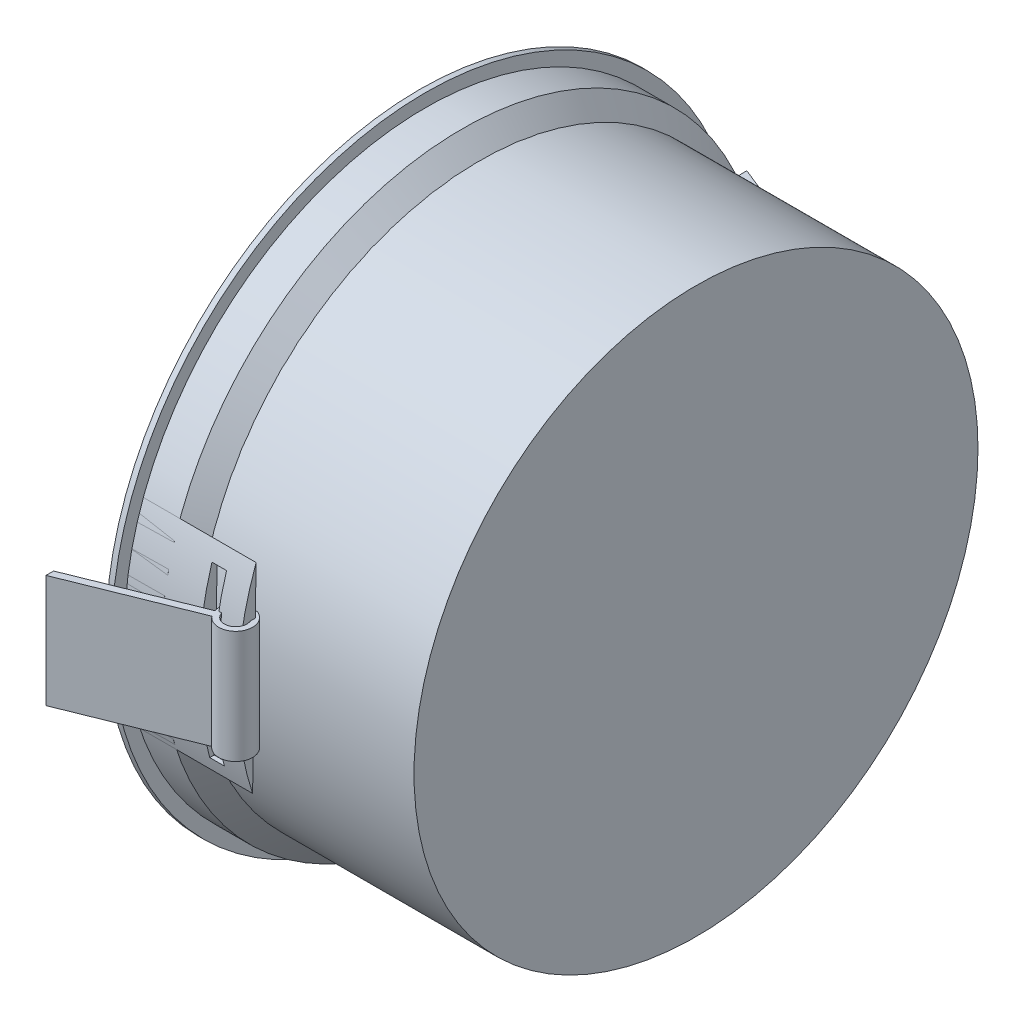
ISO-10303-21;
HEADER;
FILE_DESCRIPTION(('STEP AP214'),'2;1');
FILE_NAME('part.step','',(''),(''),'','','');
FILE_SCHEMA(('AUTOMOTIVE_DESIGN { 1 0 10303 214 1 1 1 1 }'));
ENDSEC;
DATA;
#1=APPLICATION_CONTEXT('core data for automotive mechanical design processes');
#2=APPLICATION_PROTOCOL_DEFINITION('international standard','automotive_design',2000,#1);
#3=PRODUCT_CONTEXT('',#1,'mechanical');
#4=PRODUCT('Part','Part','',(#3));
#5=PRODUCT_RELATED_PRODUCT_CATEGORY('part','',(#4));
#6=PRODUCT_DEFINITION_FORMATION('','',#4);
#7=PRODUCT_DEFINITION_CONTEXT('part definition',#1,'design');
#8=PRODUCT_DEFINITION('design','',#6,#7);
#9=PRODUCT_DEFINITION_SHAPE('','',#8);
#10=(LENGTH_UNIT() NAMED_UNIT(*) SI_UNIT(.MILLI.,.METRE.));
#11=(NAMED_UNIT(*) PLANE_ANGLE_UNIT() SI_UNIT($,.RADIAN.));
#12=(NAMED_UNIT(*) SI_UNIT($,.STERADIAN.) SOLID_ANGLE_UNIT());
#13=UNCERTAINTY_MEASURE_WITH_UNIT(LENGTH_MEASURE(1.E-05),#10,'distance_accuracy_value','');
#14=(GEOMETRIC_REPRESENTATION_CONTEXT(3) GLOBAL_UNCERTAINTY_ASSIGNED_CONTEXT((#13)) GLOBAL_UNIT_ASSIGNED_CONTEXT((#10,
#11,#12)) REPRESENTATION_CONTEXT('',''));
#15=CARTESIAN_POINT('',(0.,0.,0.));
#16=DIRECTION('',(0.,0.,1.));
#17=DIRECTION('',(1.,0.,0.));
#18=AXIS2_PLACEMENT_3D('',#15,#16,#17);
#19=CARTESIAN_POINT('',(2.97885649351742,-92.4582238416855,-60.7880048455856));
#20=DIRECTION('',(-1.,0.,0.));
#21=DIRECTION('',(0.,0.,-1.));
#22=AXIS2_PLACEMENT_3D('',#19,#20,#21);
#23=PLANE('',#22);
#24=DIRECTION('',(0.,1.,0.));
#25=VECTOR('',#24,1.);
#26=CARTESIAN_POINT('',(2.97885649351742,-92.4582238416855,-62.1341289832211));
#27=LINE('',#26,#25);
#28=CARTESIAN_POINT('',(2.97885649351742,-92.4582238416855,-62.1341289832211));
#29=VERTEX_POINT('',#28);
#30=CARTESIAN_POINT('',(2.97885649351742,-72.4582238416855,-62.1341289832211));
#31=VERTEX_POINT('',#30);
#32=EDGE_CURVE('E56',#29,#31,#27,.T.);
#33=ORIENTED_EDGE('',*,*,#32,.F.);
#34=DIRECTION('',(0.,0.,-1.));
#35=VECTOR('',#34,1.);
#36=CARTESIAN_POINT('',(2.97885649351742,-92.4582238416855,-60.7880048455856));
#37=LINE('',#36,#35);
#38=CARTESIAN_POINT('',(2.97885649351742,-92.4582238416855,-60.7880048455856));
#39=VERTEX_POINT('',#38);
#40=EDGE_CURVE('E129',#39,#29,#37,.T.);
#41=ORIENTED_EDGE('',*,*,#40,.F.);
#42=DIRECTION('',(0.,1.,0.));
#43=VECTOR('',#42,1.);
#44=CARTESIAN_POINT('',(2.97885649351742,-92.4582238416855,-60.7880048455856));
#45=LINE('',#44,#43);
#46=CARTESIAN_POINT('',(2.97885649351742,-72.4582238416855,-60.7880048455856));
#47=VERTEX_POINT('',#46);
#48=EDGE_CURVE('E12',#39,#47,#45,.T.);
#49=ORIENTED_EDGE('',*,*,#48,.T.);
#50=DIRECTION('',(0.,0.,-1.));
#51=VECTOR('',#50,1.);
#52=CARTESIAN_POINT('',(2.97885649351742,-72.4582238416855,-60.7880048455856));
#53=LINE('',#52,#51);
#54=EDGE_CURVE('E100',#47,#31,#53,.T.);
#55=ORIENTED_EDGE('',*,*,#54,.T.);
#56=EDGE_LOOP('',(#33,#41,#49,#55));
#57=FACE_BOUND('',#56,.T.);
#58=ADVANCED_FACE('F53',(#57),#23,.T.);
#59=CARTESIAN_POINT('',(23.3680732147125,-92.4582238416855,-52.581472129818));
#60=DIRECTION('',(-0.373384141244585,0.,0.92767682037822));
#61=DIRECTION('',(-0.92767682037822,0.,-0.373384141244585));
#62=AXIS2_PLACEMENT_3D('',#59,#60,#61);
#63=PLANE('',#62);
#64=ORIENTED_EDGE('',*,*,#48,.F.);
#65=DIRECTION('',(-0.92767682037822,0.,-0.373384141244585));
#66=VECTOR('',#65,1.);
#67=CARTESIAN_POINT('',(23.3680732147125,-92.4582238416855,-52.581472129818));
#68=LINE('',#67,#66);
#69=CARTESIAN_POINT('',(23.3680732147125,-92.4582238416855,-52.581472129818));
#70=VERTEX_POINT('',#69);
#71=EDGE_CURVE('E69',#70,#39,#68,.T.);
#72=ORIENTED_EDGE('',*,*,#71,.F.);
#73=DIRECTION('',(0.,1.,0.));
#74=VECTOR('',#73,1.);
#75=CARTESIAN_POINT('',(23.3680732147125,-92.4582238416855,-52.581472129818));
#76=LINE('',#75,#74);
#77=CARTESIAN_POINT('',(23.3680732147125,-72.4582238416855,-52.581472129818));
#78=VERTEX_POINT('',#77);
#79=EDGE_CURVE('E61',#70,#78,#76,.T.);
#80=ORIENTED_EDGE('',*,*,#79,.T.);
#81=DIRECTION('',(-0.92767682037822,0.,-0.373384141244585));
#82=VECTOR('',#81,1.);
#83=CARTESIAN_POINT('',(23.3680732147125,-72.4582238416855,-52.581472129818));
#84=LINE('',#83,#82);
#85=EDGE_CURVE('E122',#78,#47,#84,.T.);
#86=ORIENTED_EDGE('',*,*,#85,.T.);
#87=EDGE_LOOP('',(#64,#72,#80,#86));
#88=FACE_BOUND('',#87,.T.);
#89=ADVANCED_FACE('F121',(#88),#63,.T.);
#90=CARTESIAN_POINT('',(26.2617983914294,-92.4582238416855,-51.7900464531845));
#91=DIRECTION('',(0.,1.,0.));
#92=DIRECTION('',(0.,0.,-1.));
#93=AXIS2_PLACEMENT_3D('',#90,#91,#92);
#94=CYLINDRICAL_SURFACE('',#93,3.);
#95=ORIENTED_EDGE('',*,*,#79,.F.);
#96=CARTESIAN_POINT('',(26.2617983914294,-92.4582238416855,-51.7900464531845));
#97=DIRECTION('',(0.,-1.,0.));
#98=DIRECTION('',(0.,0.,-1.));
#99=AXIS2_PLACEMENT_3D('',#96,#97,#98);
#100=CIRCLE('',#99,3.);
#101=CARTESIAN_POINT('',(23.9446557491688,-92.4582238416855,-53.6955253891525));
#102=VERTEX_POINT('',#101);
#103=EDGE_CURVE('E74',#102,#70,#100,.T.);
#104=ORIENTED_EDGE('',*,*,#103,.F.);
#105=DIRECTION('',(0.,1.,0.));
#106=VECTOR('',#105,1.);
#107=CARTESIAN_POINT('',(23.9446557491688,-92.4582238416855,-53.6955253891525));
#108=LINE('',#107,#106);
#109=CARTESIAN_POINT('',(23.9446557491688,-72.4582238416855,-53.6955253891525));
#110=VERTEX_POINT('',#109);
#111=EDGE_CURVE('E114',#102,#110,#108,.T.);
#112=ORIENTED_EDGE('',*,*,#111,.T.);
#113=CARTESIAN_POINT('',(26.2617983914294,-72.4582238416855,-51.7900464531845));
#114=DIRECTION('',(0.,-1.,0.));
#115=DIRECTION('',(0.,0.,-1.));
#116=AXIS2_PLACEMENT_3D('',#113,#114,#115);
#117=CIRCLE('',#116,3.);
#118=EDGE_CURVE('E101',#110,#78,#117,.T.);
#119=ORIENTED_EDGE('',*,*,#118,.T.);
#120=EDGE_LOOP('',(#95,#104,#112,#119));
#121=FACE_BOUND('',#120,.T.);
#122=ADVANCED_FACE('F124',(#121),#94,.T.);
#123=CARTESIAN_POINT('',(2.97885649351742,-92.4582238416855,-62.1341289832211));
#124=DIRECTION('',(0.373384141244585,0.,-0.92767682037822));
#125=DIRECTION('',(0.92767682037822,0.,0.373384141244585));
#126=AXIS2_PLACEMENT_3D('',#123,#124,#125);
#127=PLANE('',#126);
#128=ORIENTED_EDGE('',*,*,#111,.F.);
#129=DIRECTION('',(0.92767682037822,0.,0.373384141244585));
#130=VECTOR('',#129,1.);
#131=CARTESIAN_POINT('',(2.97885649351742,-92.4582238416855,-62.1341289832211));
#132=LINE('',#131,#130);
#133=EDGE_CURVE('E113',#29,#102,#132,.T.);
#134=ORIENTED_EDGE('',*,*,#133,.F.);
#135=ORIENTED_EDGE('',*,*,#32,.T.);
#136=DIRECTION('',(0.92767682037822,0.,0.373384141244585));
#137=VECTOR('',#136,1.);
#138=CARTESIAN_POINT('',(2.97885649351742,-72.4582238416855,-62.1341289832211));
#139=LINE('',#138,#137);
#140=EDGE_CURVE('E95',#31,#110,#139,.T.);
#141=ORIENTED_EDGE('',*,*,#140,.T.);
#142=EDGE_LOOP('',(#128,#134,#135,#141));
#143=FACE_BOUND('',#142,.T.);
#144=ADVANCED_FACE('F112',(#143),#127,.T.);
#145=CARTESIAN_POINT('',(26.2617983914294,-92.4582238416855,-51.7900464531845));
#146=DIRECTION('',(0.,1.,0.));
#147=DIRECTION('',(0.,0.,-1.));
#148=AXIS2_PLACEMENT_3D('',#145,#146,#147);
#149=PLANE('',#148);
#150=CARTESIAN_POINT('',(26.2617983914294,-92.4582238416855,-51.7900464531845));
#151=DIRECTION('',(0.,-1.,0.));
#152=DIRECTION('',(0.,0.,-1.));
#153=AXIS2_PLACEMENT_3D('',#150,#151,#152);
#154=CIRCLE('',#153,2.00000000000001);
#155=CARTESIAN_POINT('',(26.2617983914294,-92.4582238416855,-53.7900464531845));
#156=VERTEX_POINT('',#155);
#157=EDGE_CURVE('E126',#156,#156,#154,.T.);
#158=ORIENTED_EDGE('',*,*,#157,.F.);
#159=EDGE_LOOP('',(#158));
#160=FACE_BOUND('',#159,.T.);
#161=ORIENTED_EDGE('',*,*,#40,.T.);
#162=ORIENTED_EDGE('',*,*,#133,.T.);
#163=ORIENTED_EDGE('',*,*,#103,.T.);
#164=ORIENTED_EDGE('',*,*,#71,.T.);
#165=EDGE_LOOP('',(#161,#162,#163,#164));
#166=FACE_BOUND('',#165,.T.);
#167=ADVANCED_FACE('F132',(#160,#166),#149,.F.);
#168=CARTESIAN_POINT('',(26.2617983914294,-92.4582238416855,-51.7900464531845));
#169=DIRECTION('',(0.,1.,0.));
#170=DIRECTION('',(0.,0.,-1.));
#171=AXIS2_PLACEMENT_3D('',#168,#169,#170);
#172=CYLINDRICAL_SURFACE('',#171,2.00000000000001);
#173=ORIENTED_EDGE('',*,*,#157,.T.);
#174=EDGE_LOOP('',(#173));
#175=FACE_BOUND('',#174,.T.);
#176=CARTESIAN_POINT('',(26.2617983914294,-72.4582238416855,-51.7900464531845));
#177=DIRECTION('',(0.,-1.,0.));
#178=DIRECTION('',(0.,0.,-1.));
#179=AXIS2_PLACEMENT_3D('',#176,#177,#178);
#180=CIRCLE('',#179,2.00000000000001);
#181=CARTESIAN_POINT('',(26.2617983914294,-72.4582238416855,-53.7900464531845));
#182=VERTEX_POINT('',#181);
#183=EDGE_CURVE('E110',#182,#182,#180,.T.);
#184=ORIENTED_EDGE('',*,*,#183,.F.);
#185=EDGE_LOOP('',(#184));
#186=FACE_BOUND('',#185,.T.);
#187=ADVANCED_FACE('F134',(#175,#186),#172,.F.);
#188=CARTESIAN_POINT('',(26.2617983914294,-72.4582238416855,-51.7900464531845));
#189=DIRECTION('',(0.,1.,0.));
#190=DIRECTION('',(0.,0.,-1.));
#191=AXIS2_PLACEMENT_3D('',#188,#189,#190);
#192=PLANE('',#191);
#193=ORIENTED_EDGE('',*,*,#54,.F.);
#194=ORIENTED_EDGE('',*,*,#85,.F.);
#195=ORIENTED_EDGE('',*,*,#118,.F.);
#196=ORIENTED_EDGE('',*,*,#140,.F.);
#197=EDGE_LOOP('',(#193,#194,#195,#196));
#198=FACE_BOUND('',#197,.T.);
#199=ORIENTED_EDGE('',*,*,#183,.T.);
#200=EDGE_LOOP('',(#199));
#201=FACE_BOUND('',#200,.T.);
#202=ADVANCED_FACE('F97',(#198,#201),#192,.T.);
#203=CLOSED_SHELL('',(#58,#89,#122,#144,#167,#187,#202));
#204=MANIFOLD_SOLID_BREP('B2',#203);
#205=CARTESIAN_POINT('',(2.97885649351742,-92.4582238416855,60.7880048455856));
#206=DIRECTION('',(-1.,0.,0.));
#207=DIRECTION('',(0.,0.,1.));
#208=AXIS2_PLACEMENT_3D('',#205,#206,#207);
#209=PLANE('',#208);
#210=DIRECTION('',(0.,1.,0.));
#211=VECTOR('',#210,1.);
#212=CARTESIAN_POINT('',(2.97885649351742,-92.4582238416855,62.1341289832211));
#213=LINE('',#212,#211);
#214=CARTESIAN_POINT('',(2.97885649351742,-92.4582238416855,62.1341289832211));
#215=VERTEX_POINT('',#214);
#216=CARTESIAN_POINT('',(2.97885649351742,-72.4582238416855,62.1341289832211));
#217=VERTEX_POINT('',#216);
#218=EDGE_CURVE('E210',#215,#217,#213,.T.);
#219=ORIENTED_EDGE('',*,*,#218,.T.);
#220=DIRECTION('',(0.,0.,1.));
#221=VECTOR('',#220,1.);
#222=CARTESIAN_POINT('',(2.97885649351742,-72.4582238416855,60.7880048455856));
#223=LINE('',#222,#221);
#224=CARTESIAN_POINT('',(2.97885649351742,-72.4582238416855,60.7880048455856));
#225=VERTEX_POINT('',#224);
#226=EDGE_CURVE('E247',#225,#217,#223,.T.);
#227=ORIENTED_EDGE('',*,*,#226,.F.);
#228=DIRECTION('',(0.,1.,0.));
#229=VECTOR('',#228,1.);
#230=CARTESIAN_POINT('',(2.97885649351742,-92.4582238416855,60.7880048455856));
#231=LINE('',#230,#229);
#232=CARTESIAN_POINT('',(2.97885649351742,-92.4582238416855,60.7880048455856));
#233=VERTEX_POINT('',#232);
#234=EDGE_CURVE('E51',#233,#225,#231,.T.);
#235=ORIENTED_EDGE('',*,*,#234,.F.);
#236=DIRECTION('',(0.,0.,1.));
#237=VECTOR('',#236,1.);
#238=CARTESIAN_POINT('',(2.97885649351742,-92.4582238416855,60.7880048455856));
#239=LINE('',#238,#237);
#240=EDGE_CURVE('E248',#233,#215,#239,.T.);
#241=ORIENTED_EDGE('',*,*,#240,.T.);
#242=EDGE_LOOP('',(#219,#227,#235,#241));
#243=FACE_BOUND('',#242,.T.);
#244=ADVANCED_FACE('F207',(#243),#209,.T.);
#245=CARTESIAN_POINT('',(23.3680732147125,-92.4582238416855,52.581472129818));
#246=DIRECTION('',(-0.373384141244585,0.,-0.92767682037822));
#247=DIRECTION('',(-0.92767682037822,0.,0.373384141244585));
#248=AXIS2_PLACEMENT_3D('',#245,#246,#247);
#249=PLANE('',#248);
#250=ORIENTED_EDGE('',*,*,#234,.T.);
#251=DIRECTION('',(-0.92767682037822,0.,0.373384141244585));
#252=VECTOR('',#251,1.);
#253=CARTESIAN_POINT('',(23.3680732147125,-72.4582238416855,52.581472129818));
#254=LINE('',#253,#252);
#255=CARTESIAN_POINT('',(23.3680732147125,-72.4582238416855,52.581472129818));
#256=VERTEX_POINT('',#255);
#257=EDGE_CURVE('E265',#256,#225,#254,.T.);
#258=ORIENTED_EDGE('',*,*,#257,.F.);
#259=DIRECTION('',(0.,1.,0.));
#260=VECTOR('',#259,1.);
#261=CARTESIAN_POINT('',(23.3680732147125,-92.4582238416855,52.581472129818));
#262=LINE('',#261,#260);
#263=CARTESIAN_POINT('',(23.3680732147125,-92.4582238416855,52.581472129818));
#264=VERTEX_POINT('',#263);
#265=EDGE_CURVE('E215',#264,#256,#262,.T.);
#266=ORIENTED_EDGE('',*,*,#265,.F.);
#267=DIRECTION('',(-0.92767682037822,0.,0.373384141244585));
#268=VECTOR('',#267,1.);
#269=CARTESIAN_POINT('',(23.3680732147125,-92.4582238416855,52.581472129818));
#270=LINE('',#269,#268);
#271=EDGE_CURVE('E253',#264,#233,#270,.T.);
#272=ORIENTED_EDGE('',*,*,#271,.T.);
#273=EDGE_LOOP('',(#250,#258,#266,#272));
#274=FACE_BOUND('',#273,.T.);
#275=ADVANCED_FACE('F286',(#274),#249,.T.);
#276=CARTESIAN_POINT('',(26.2617983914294,-92.4582238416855,51.7900464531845));
#277=DIRECTION('',(0.,1.,0.));
#278=DIRECTION('',(0.,0.,1.));
#279=AXIS2_PLACEMENT_3D('',#276,#277,#278);
#280=CYLINDRICAL_SURFACE('',#279,3.);
#281=ORIENTED_EDGE('',*,*,#265,.T.);
#282=CARTESIAN_POINT('',(26.2617983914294,-72.4582238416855,51.7900464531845));
#283=DIRECTION('',(0.,1.,0.));
#284=DIRECTION('',(0.,0.,1.));
#285=AXIS2_PLACEMENT_3D('',#282,#283,#284);
#286=CIRCLE('',#285,3.);
#287=CARTESIAN_POINT('',(23.9446557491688,-72.4582238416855,53.6955253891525));
#288=VERTEX_POINT('',#287);
#289=EDGE_CURVE('E260',#288,#256,#286,.T.);
#290=ORIENTED_EDGE('',*,*,#289,.F.);
#291=DIRECTION('',(0.,1.,0.));
#292=VECTOR('',#291,1.);
#293=CARTESIAN_POINT('',(23.9446557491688,-92.4582238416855,53.6955253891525));
#294=LINE('',#293,#292);
#295=CARTESIAN_POINT('',(23.9446557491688,-92.4582238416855,53.6955253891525));
#296=VERTEX_POINT('',#295);
#297=EDGE_CURVE('E252',#296,#288,#294,.T.);
#298=ORIENTED_EDGE('',*,*,#297,.F.);
#299=CARTESIAN_POINT('',(26.2617983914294,-92.4582238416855,51.7900464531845));
#300=DIRECTION('',(0.,1.,0.));
#301=DIRECTION('',(0.,0.,1.));
#302=AXIS2_PLACEMENT_3D('',#299,#300,#301);
#303=CIRCLE('',#302,3.);
#304=EDGE_CURVE('E279',#296,#264,#303,.T.);
#305=ORIENTED_EDGE('',*,*,#304,.T.);
#306=EDGE_LOOP('',(#281,#290,#298,#305));
#307=FACE_BOUND('',#306,.T.);
#308=ADVANCED_FACE('F283',(#307),#280,.T.);
#309=CARTESIAN_POINT('',(2.97885649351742,-92.4582238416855,62.1341289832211));
#310=DIRECTION('',(0.373384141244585,0.,0.92767682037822));
#311=DIRECTION('',(0.92767682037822,0.,-0.373384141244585));
#312=AXIS2_PLACEMENT_3D('',#309,#310,#311);
#313=PLANE('',#312);
#314=ORIENTED_EDGE('',*,*,#297,.T.);
#315=DIRECTION('',(0.92767682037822,0.,-0.373384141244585));
#316=VECTOR('',#315,1.);
#317=CARTESIAN_POINT('',(2.97885649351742,-72.4582238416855,62.1341289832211));
#318=LINE('',#317,#316);
#319=EDGE_CURVE('E255',#217,#288,#318,.T.);
#320=ORIENTED_EDGE('',*,*,#319,.F.);
#321=ORIENTED_EDGE('',*,*,#218,.F.);
#322=DIRECTION('',(0.92767682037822,0.,-0.373384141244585));
#323=VECTOR('',#322,1.);
#324=CARTESIAN_POINT('',(2.97885649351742,-92.4582238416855,62.1341289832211));
#325=LINE('',#324,#323);
#326=EDGE_CURVE('E277',#215,#296,#325,.T.);
#327=ORIENTED_EDGE('',*,*,#326,.T.);
#328=EDGE_LOOP('',(#314,#320,#321,#327));
#329=FACE_BOUND('',#328,.T.);
#330=ADVANCED_FACE('F256',(#329),#313,.T.);
#331=CARTESIAN_POINT('',(26.2617983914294,-92.4582238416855,51.7900464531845));
#332=DIRECTION('',(0.,1.,0.));
#333=DIRECTION('',(0.,0.,1.));
#334=AXIS2_PLACEMENT_3D('',#331,#332,#333);
#335=PLANE('',#334);
#336=CARTESIAN_POINT('',(26.2617983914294,-92.4582238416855,51.7900464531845));
#337=DIRECTION('',(0.,1.,0.));
#338=DIRECTION('',(0.,0.,1.));
#339=AXIS2_PLACEMENT_3D('',#336,#337,#338);
#340=CIRCLE('',#339,2.00000000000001);
#341=CARTESIAN_POINT('',(26.2617983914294,-92.4582238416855,53.7900464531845));
#342=VERTEX_POINT('',#341);
#343=EDGE_CURVE('E273',#342,#342,#340,.T.);
#344=ORIENTED_EDGE('',*,*,#343,.T.);
#345=EDGE_LOOP('',(#344));
#346=FACE_BOUND('',#345,.T.);
#347=ORIENTED_EDGE('',*,*,#240,.F.);
#348=ORIENTED_EDGE('',*,*,#271,.F.);
#349=ORIENTED_EDGE('',*,*,#304,.F.);
#350=ORIENTED_EDGE('',*,*,#326,.F.);
#351=EDGE_LOOP('',(#347,#348,#349,#350));
#352=FACE_BOUND('',#351,.T.);
#353=ADVANCED_FACE('F288',(#346,#352),#335,.F.);
#354=CARTESIAN_POINT('',(26.2617983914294,-92.4582238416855,51.7900464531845));
#355=DIRECTION('',(0.,1.,0.));
#356=DIRECTION('',(0.,0.,1.));
#357=AXIS2_PLACEMENT_3D('',#354,#355,#356);
#358=CYLINDRICAL_SURFACE('',#357,2.00000000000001);
#359=ORIENTED_EDGE('',*,*,#343,.F.);
#360=EDGE_LOOP('',(#359));
#361=FACE_BOUND('',#360,.T.);
#362=CARTESIAN_POINT('',(26.2617983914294,-72.4582238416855,51.7900464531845));
#363=DIRECTION('',(0.,1.,0.));
#364=DIRECTION('',(0.,0.,1.));
#365=AXIS2_PLACEMENT_3D('',#362,#363,#364);
#366=CIRCLE('',#365,2.00000000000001);
#367=CARTESIAN_POINT('',(26.2617983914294,-72.4582238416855,53.7900464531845));
#368=VERTEX_POINT('',#367);
#369=EDGE_CURVE('E266',#368,#368,#366,.T.);
#370=ORIENTED_EDGE('',*,*,#369,.T.);
#371=EDGE_LOOP('',(#370));
#372=FACE_BOUND('',#371,.T.);
#373=ADVANCED_FACE('F290',(#361,#372),#358,.F.);
#374=CARTESIAN_POINT('',(26.2617983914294,-72.4582238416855,51.7900464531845));
#375=DIRECTION('',(0.,1.,0.));
#376=DIRECTION('',(0.,0.,1.));
#377=AXIS2_PLACEMENT_3D('',#374,#375,#376);
#378=PLANE('',#377);
#379=ORIENTED_EDGE('',*,*,#226,.T.);
#380=ORIENTED_EDGE('',*,*,#319,.T.);
#381=ORIENTED_EDGE('',*,*,#289,.T.);
#382=ORIENTED_EDGE('',*,*,#257,.T.);
#383=EDGE_LOOP('',(#379,#380,#381,#382));
#384=FACE_BOUND('',#383,.T.);
#385=ORIENTED_EDGE('',*,*,#369,.F.);
#386=EDGE_LOOP('',(#385));
#387=FACE_BOUND('',#386,.T.);
#388=ADVANCED_FACE('F263',(#384,#387),#378,.T.);
#389=CLOSED_SHELL('',(#244,#275,#308,#330,#353,#373,#388));
#390=MANIFOLD_SOLID_BREP('B6',#389);
#391=CARTESIAN_POINT('',(28.1087516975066,-82.4582238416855,0.));
#392=DIRECTION('',(-1.,0.,0.));
#393=DIRECTION('',(0.,0.,1.));
#394=AXIS2_PLACEMENT_3D('',#391,#392,#393);
#395=CYLINDRICAL_SURFACE('',#394,53.3072859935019);
#396=CARTESIAN_POINT('',(8.10875169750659,-82.4582238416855,0.));
#397=DIRECTION('',(1.,0.,0.));
#398=DIRECTION('',(0.,0.,-1.));
#399=AXIS2_PLACEMENT_3D('',#396,#397,#398);
#400=CIRCLE('',#399,53.3072859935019);
#401=CARTESIAN_POINT('',(8.10875169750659,-99.1309568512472,-50.632861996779));
#402=VERTEX_POINT('',#401);
#403=CARTESIAN_POINT('',(8.10875169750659,-63.9866371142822,-50.0046720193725));
#404=VERTEX_POINT('',#403);
#405=EDGE_CURVE('E434',#402,#404,#400,.T.);
#406=ORIENTED_EDGE('',*,*,#405,.T.);
#407=DIRECTION('',(-1.,0.,0.));
#408=VECTOR('',#407,1.);
#409=CARTESIAN_POINT('',(28.1087516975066,-63.9866371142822,-50.0046720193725));
#410=LINE('',#409,#408);
#411=CARTESIAN_POINT('',(28.1087516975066,-63.9866371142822,-50.0046720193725));
#412=VERTEX_POINT('',#411);
#413=EDGE_CURVE('E447',#412,#404,#410,.T.);
#414=ORIENTED_EDGE('',*,*,#413,.F.);
#415=CARTESIAN_POINT('',(28.1087516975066,-82.4582238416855,0.));
#416=DIRECTION('',(1.,0.,0.));
#417=DIRECTION('',(0.,0.,-1.));
#418=AXIS2_PLACEMENT_3D('',#415,#416,#417);
#419=CIRCLE('',#418,53.3072859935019);
#420=CARTESIAN_POINT('',(28.1087516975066,-99.1309568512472,-50.632861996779));
#421=VERTEX_POINT('',#420);
#422=EDGE_CURVE('E435',#421,#412,#419,.T.);
#423=ORIENTED_EDGE('',*,*,#422,.F.);
#424=DIRECTION('',(-1.,0.,0.));
#425=VECTOR('',#424,1.);
#426=CARTESIAN_POINT('',(28.1087516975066,-99.1309568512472,-50.632861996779));
#427=LINE('',#426,#425);
#428=EDGE_CURVE('E441',#421,#402,#427,.T.);
#429=ORIENTED_EDGE('',*,*,#428,.T.);
#430=EDGE_LOOP('',(#406,#414,#423,#429));
#431=FACE_BOUND('',#430,.T.);
#432=CARTESIAN_POINT('',(23.8362576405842,-82.4582238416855,0.));
#433=DIRECTION('',(-1.,0.,0.));
#434=DIRECTION('',(0.,-1.,0.));
#435=AXIS2_PLACEMENT_3D('',#432,#433,#434);
#436=CIRCLE('',#435,53.3072859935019);
#437=CARTESIAN_POINT('',(23.8362576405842,-66.8680842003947,-50.976605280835));
#438=VERTEX_POINT('',#437);
#439=CARTESIAN_POINT('',(23.8362576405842,-96.6794731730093,-51.3753132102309));
#440=VERTEX_POINT('',#439);
#441=EDGE_CURVE('E429',#438,#440,#436,.T.);
#442=ORIENTED_EDGE('',*,*,#441,.F.);
#443=DIRECTION('',(-1.,0.,0.));
#444=VECTOR('',#443,1.);
#445=CARTESIAN_POINT('',(28.1087516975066,-66.8680842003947,-50.976605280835));
#446=LINE('',#445,#444);
#447=CARTESIAN_POINT('',(21.2505759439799,-66.8680842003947,-50.976605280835));
#448=VERTEX_POINT('',#447);
#449=EDGE_CURVE('E427',#448,#438,#446,.F.);
#450=ORIENTED_EDGE('',*,*,#449,.F.);
#451=CARTESIAN_POINT('',(21.2505759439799,-82.4582238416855,0.));
#452=DIRECTION('',(1.,0.,0.));
#453=DIRECTION('',(0.,1.,0.));
#454=AXIS2_PLACEMENT_3D('',#451,#452,#453);
#455=CIRCLE('',#454,53.3072859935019);
#456=CARTESIAN_POINT('',(21.2505759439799,-96.6794731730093,-51.3753132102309));
#457=VERTEX_POINT('',#456);
#458=EDGE_CURVE('E414',#457,#448,#455,.T.);
#459=ORIENTED_EDGE('',*,*,#458,.F.);
#460=DIRECTION('',(-1.,0.,0.));
#461=VECTOR('',#460,1.);
#462=CARTESIAN_POINT('',(28.1087516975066,-96.6794731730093,-51.3753132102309));
#463=LINE('',#462,#461);
#464=EDGE_CURVE('E409',#440,#457,#463,.T.);
#465=ORIENTED_EDGE('',*,*,#464,.F.);
#466=EDGE_LOOP('',(#442,#450,#459,#465));
#467=FACE_BOUND('',#466,.T.);
#468=ADVANCED_FACE('F361',(#431,#467),#395,.T.);
#469=CARTESIAN_POINT('',(28.1087516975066,-63.9866371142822,-50.0046720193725));
#470=DIRECTION('',(0.,0.0178717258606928,-0.999840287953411));
#471=DIRECTION('',(0.,0.999840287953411,0.0178717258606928));
#472=AXIS2_PLACEMENT_3D('',#469,#470,#471);
#473=PLANE('',#472);
#474=DIRECTION('',(0.,-0.999840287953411,-0.0178717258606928));
#475=VECTOR('',#474,1.);
#476=CARTESIAN_POINT('',(8.10875169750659,-63.9866371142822,-50.0046720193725));
#477=LINE('',#476,#475);
#478=EDGE_CURVE('E439',#404,#402,#477,.T.);
#479=ORIENTED_EDGE('',*,*,#478,.T.);
#480=ORIENTED_EDGE('',*,*,#428,.F.);
#481=DIRECTION('',(0.,-0.999840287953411,-0.0178717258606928));
#482=VECTOR('',#481,1.);
#483=CARTESIAN_POINT('',(28.1087516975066,-63.9866371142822,-50.0046720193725));
#484=LINE('',#483,#482);
#485=EDGE_CURVE('E438',#412,#421,#484,.T.);
#486=ORIENTED_EDGE('',*,*,#485,.F.);
#487=ORIENTED_EDGE('',*,*,#413,.T.);
#488=EDGE_LOOP('',(#479,#480,#486,#487));
#489=FACE_BOUND('',#488,.T.);
#490=DIRECTION('',(0.,0.999840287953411,0.0178717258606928));
#491=VECTOR('',#490,1.);
#492=CARTESIAN_POINT('',(23.8362576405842,-63.9866371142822,-50.0046720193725));
#493=LINE('',#492,#491);
#494=CARTESIAN_POINT('',(23.8362576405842,-96.6794731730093,-50.5890427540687));
#495=VERTEX_POINT('',#494);
#496=CARTESIAN_POINT('',(23.8362576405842,-66.8680842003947,-50.056176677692));
#497=VERTEX_POINT('',#496);
#498=EDGE_CURVE('E205',#495,#497,#493,.T.);
#499=ORIENTED_EDGE('',*,*,#498,.F.);
#500=DIRECTION('',(1.,0.,0.));
#501=VECTOR('',#500,1.);
#502=CARTESIAN_POINT('',(28.1087516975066,-96.6794731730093,-50.5890427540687));
#503=LINE('',#502,#501);
#504=CARTESIAN_POINT('',(21.2505759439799,-96.6794731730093,-50.5890427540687));
#505=VERTEX_POINT('',#504);
#506=EDGE_CURVE('E450',#505,#495,#503,.T.);
#507=ORIENTED_EDGE('',*,*,#506,.F.);
#508=DIRECTION('',(0.,-0.999840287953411,-0.0178717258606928));
#509=VECTOR('',#508,1.);
#510=CARTESIAN_POINT('',(21.2505759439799,-63.9866371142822,-50.0046720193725));
#511=LINE('',#510,#509);
#512=CARTESIAN_POINT('',(21.2505759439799,-66.8680842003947,-50.056176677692));
#513=VERTEX_POINT('',#512);
#514=EDGE_CURVE('E422',#513,#505,#511,.T.);
#515=ORIENTED_EDGE('',*,*,#514,.F.);
#516=DIRECTION('',(-1.,0.,0.));
#517=VECTOR('',#516,1.);
#518=CARTESIAN_POINT('',(28.1087516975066,-66.8680842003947,-50.056176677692));
#519=LINE('',#518,#517);
#520=EDGE_CURVE('E368',#497,#513,#519,.T.);
#521=ORIENTED_EDGE('',*,*,#520,.F.);
#522=EDGE_LOOP('',(#499,#507,#515,#521));
#523=FACE_BOUND('',#522,.T.);
#524=ADVANCED_FACE('F460',(#489,#523),#473,.F.);
#525=CARTESIAN_POINT('',(28.1087516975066,-82.4582238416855,0.));
#526=DIRECTION('',(1.,0.,0.));
#527=DIRECTION('',(0.,0.,-1.));
#528=AXIS2_PLACEMENT_3D('',#525,#526,#527);
#529=PLANE('',#528);
#530=ORIENTED_EDGE('',*,*,#422,.T.);
#531=ORIENTED_EDGE('',*,*,#485,.T.);
#532=EDGE_LOOP('',(#530,#531));
#533=FACE_BOUND('',#532,.T.);
#534=ADVANCED_FACE('F472',(#533),#529,.T.);
#535=CARTESIAN_POINT('',(8.10875169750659,-82.4582238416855,0.));
#536=DIRECTION('',(1.,0.,0.));
#537=DIRECTION('',(0.,0.,-1.));
#538=AXIS2_PLACEMENT_3D('',#535,#536,#537);
#539=PLANE('',#538);
#540=ORIENTED_EDGE('',*,*,#405,.F.);
#541=ORIENTED_EDGE('',*,*,#478,.F.);
#542=EDGE_LOOP('',(#540,#541));
#543=FACE_BOUND('',#542,.T.);
#544=ADVANCED_FACE('F465',(#543),#539,.F.);
#545=CARTESIAN_POINT('',(23.8362576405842,-66.8680842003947,70.));
#546=DIRECTION('',(-1.,0.,0.));
#547=DIRECTION('',(0.,-1.,0.));
#548=AXIS2_PLACEMENT_3D('',#545,#546,#547);
#549=PLANE('',#548);
#550=ORIENTED_EDGE('',*,*,#441,.T.);
#551=DIRECTION('',(0.,0.,-1.));
#552=VECTOR('',#551,1.);
#553=CARTESIAN_POINT('',(23.8362576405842,-96.6794731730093,70.));
#554=LINE('',#553,#552);
#555=EDGE_CURVE('E375',#495,#440,#554,.T.);
#556=ORIENTED_EDGE('',*,*,#555,.F.);
#557=ORIENTED_EDGE('',*,*,#498,.T.);
#558=DIRECTION('',(0.,0.,-1.));
#559=VECTOR('',#558,1.);
#560=CARTESIAN_POINT('',(23.8362576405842,-66.8680842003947,70.));
#561=LINE('',#560,#559);
#562=EDGE_CURVE('E415',#497,#438,#561,.T.);
#563=ORIENTED_EDGE('',*,*,#562,.T.);
#564=EDGE_LOOP('',(#550,#556,#557,#563));
#565=FACE_BOUND('',#564,.T.);
#566=ADVANCED_FACE('F462',(#565),#549,.T.);
#567=CARTESIAN_POINT('',(23.8362576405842,-66.8680842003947,70.));
#568=DIRECTION('',(0.,-1.,0.));
#569=DIRECTION('',(0.,0.,-1.));
#570=AXIS2_PLACEMENT_3D('',#567,#568,#569);
#571=PLANE('',#570);
#572=ORIENTED_EDGE('',*,*,#449,.T.);
#573=ORIENTED_EDGE('',*,*,#562,.F.);
#574=ORIENTED_EDGE('',*,*,#520,.T.);
#575=DIRECTION('',(0.,0.,-1.));
#576=VECTOR('',#575,1.);
#577=CARTESIAN_POINT('',(21.2505759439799,-66.8680842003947,70.));
#578=LINE('',#577,#576);
#579=EDGE_CURVE('E424',#513,#448,#578,.T.);
#580=ORIENTED_EDGE('',*,*,#579,.T.);
#581=EDGE_LOOP('',(#572,#573,#574,#580));
#582=FACE_BOUND('',#581,.T.);
#583=ADVANCED_FACE('F455',(#582),#571,.T.);
#584=CARTESIAN_POINT('',(21.2505759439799,-66.8680842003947,70.));
#585=DIRECTION('',(1.,0.,0.));
#586=DIRECTION('',(0.,1.,0.));
#587=AXIS2_PLACEMENT_3D('',#584,#585,#586);
#588=PLANE('',#587);
#589=ORIENTED_EDGE('',*,*,#458,.T.);
#590=ORIENTED_EDGE('',*,*,#579,.F.);
#591=ORIENTED_EDGE('',*,*,#514,.T.);
#592=DIRECTION('',(0.,0.,-1.));
#593=VECTOR('',#592,1.);
#594=CARTESIAN_POINT('',(21.2505759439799,-96.6794731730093,70.));
#595=LINE('',#594,#593);
#596=EDGE_CURVE('E380',#505,#457,#595,.T.);
#597=ORIENTED_EDGE('',*,*,#596,.T.);
#598=EDGE_LOOP('',(#589,#590,#591,#597));
#599=FACE_BOUND('',#598,.T.);
#600=ADVANCED_FACE('F418',(#599),#588,.T.);
#601=CARTESIAN_POINT('',(23.8362576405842,-96.6794731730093,70.));
#602=DIRECTION('',(0.,1.,0.));
#603=DIRECTION('',(0.,0.,1.));
#604=AXIS2_PLACEMENT_3D('',#601,#602,#603);
#605=PLANE('',#604);
#606=ORIENTED_EDGE('',*,*,#464,.T.);
#607=ORIENTED_EDGE('',*,*,#596,.F.);
#608=ORIENTED_EDGE('',*,*,#506,.T.);
#609=ORIENTED_EDGE('',*,*,#555,.T.);
#610=EDGE_LOOP('',(#606,#607,#608,#609));
#611=FACE_BOUND('',#610,.T.);
#612=ADVANCED_FACE('F410',(#611),#605,.T.);
#613=CLOSED_SHELL('',(#468,#524,#534,#544,#566,#583,#600,#612));
#614=MANIFOLD_SOLID_BREP('B45',#613);
#615=CARTESIAN_POINT('',(28.1087516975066,-82.4582238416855,0.));
#616=DIRECTION('',(-1.,0.,0.));
#617=DIRECTION('',(0.,0.,1.));
#618=AXIS2_PLACEMENT_3D('',#615,#616,#617);
#619=CYLINDRICAL_SURFACE('',#618,53.3072859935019);
#620=CARTESIAN_POINT('',(8.10875169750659,-82.4582238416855,0.));
#621=DIRECTION('',(1.,0.,0.));
#622=DIRECTION('',(0.,0.,-1.));
#623=AXIS2_PLACEMENT_3D('',#620,#621,#622);
#624=CIRCLE('',#623,53.3072859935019);
#625=CARTESIAN_POINT('',(8.10875169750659,-63.9866371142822,50.0046720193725));
#626=VERTEX_POINT('',#625);
#627=CARTESIAN_POINT('',(8.10875169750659,-99.1309568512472,50.632861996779));
#628=VERTEX_POINT('',#627);
#629=EDGE_CURVE('E624',#626,#628,#624,.T.);
#630=ORIENTED_EDGE('',*,*,#629,.T.);
#631=DIRECTION('',(-1.,0.,0.));
#632=VECTOR('',#631,1.);
#633=CARTESIAN_POINT('',(28.1087516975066,-99.1309568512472,50.632861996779));
#634=LINE('',#633,#632);
#635=CARTESIAN_POINT('',(28.1087516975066,-99.1309568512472,50.632861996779));
#636=VERTEX_POINT('',#635);
#637=EDGE_CURVE('E600',#636,#628,#634,.T.);
#638=ORIENTED_EDGE('',*,*,#637,.F.);
#639=CARTESIAN_POINT('',(28.1087516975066,-82.4582238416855,0.));
#640=DIRECTION('',(1.,0.,0.));
#641=DIRECTION('',(0.,0.,-1.));
#642=AXIS2_PLACEMENT_3D('',#639,#640,#641);
#643=CIRCLE('',#642,53.3072859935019);
#644=CARTESIAN_POINT('',(28.1087516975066,-63.9866371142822,50.0046720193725));
#645=VERTEX_POINT('',#644);
#646=EDGE_CURVE('E623',#645,#636,#643,.T.);
#647=ORIENTED_EDGE('',*,*,#646,.F.);
#648=DIRECTION('',(-1.,0.,0.));
#649=VECTOR('',#648,1.);
#650=CARTESIAN_POINT('',(28.1087516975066,-63.9866371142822,50.0046720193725));
#651=LINE('',#650,#649);
#652=EDGE_CURVE('E617',#645,#626,#651,.T.);
#653=ORIENTED_EDGE('',*,*,#652,.T.);
#654=EDGE_LOOP('',(#630,#638,#647,#653));
#655=FACE_BOUND('',#654,.T.);
#656=CARTESIAN_POINT('',(23.8362576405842,-82.4582238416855,0.));
#657=DIRECTION('',(-1.,0.,0.));
#658=DIRECTION('',(0.,-1.,0.));
#659=AXIS2_PLACEMENT_3D('',#656,#657,#658);
#660=CIRCLE('',#659,53.3072859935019);
#661=CARTESIAN_POINT('',(23.8362576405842,-96.6794731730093,51.3753132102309));
#662=VERTEX_POINT('',#661);
#663=CARTESIAN_POINT('',(23.8362576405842,-66.8680842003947,50.976605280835));
#664=VERTEX_POINT('',#663);
#665=EDGE_CURVE('E627',#662,#664,#660,.T.);
#666=ORIENTED_EDGE('',*,*,#665,.F.);
#667=DIRECTION('',(-1.,0.,0.));
#668=VECTOR('',#667,1.);
#669=CARTESIAN_POINT('',(28.1087516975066,-96.6794731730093,51.3753132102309));
#670=LINE('',#669,#668);
#671=CARTESIAN_POINT('',(21.2505759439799,-96.6794731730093,51.3753132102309));
#672=VERTEX_POINT('',#671);
#673=EDGE_CURVE('E635',#672,#662,#670,.F.);
#674=ORIENTED_EDGE('',*,*,#673,.F.);
#675=CARTESIAN_POINT('',(21.2505759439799,-82.4582238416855,0.));
#676=DIRECTION('',(1.,0.,0.));
#677=DIRECTION('',(0.,1.,0.));
#678=AXIS2_PLACEMENT_3D('',#675,#676,#677);
#679=CIRCLE('',#678,53.3072859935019);
#680=CARTESIAN_POINT('',(21.2505759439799,-66.8680842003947,50.976605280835));
#681=VERTEX_POINT('',#680);
#682=EDGE_CURVE('E607',#681,#672,#679,.T.);
#683=ORIENTED_EDGE('',*,*,#682,.F.);
#684=DIRECTION('',(-1.,0.,0.));
#685=VECTOR('',#684,1.);
#686=CARTESIAN_POINT('',(28.1087516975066,-66.8680842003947,50.976605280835));
#687=LINE('',#686,#685);
#688=EDGE_CURVE('E632',#664,#681,#687,.T.);
#689=ORIENTED_EDGE('',*,*,#688,.F.);
#690=EDGE_LOOP('',(#666,#674,#683,#689));
#691=FACE_BOUND('',#690,.T.);
#692=ADVANCED_FACE('F546',(#655,#691),#619,.T.);
#693=CARTESIAN_POINT('',(28.1087516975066,-63.9866371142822,50.0046720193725));
#694=DIRECTION('',(0.,0.0178717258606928,0.999840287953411));
#695=DIRECTION('',(0.,-0.999840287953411,0.0178717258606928));
#696=AXIS2_PLACEMENT_3D('',#693,#694,#695);
#697=PLANE('',#696);
#698=DIRECTION('',(0.,0.999840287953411,-0.0178717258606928));
#699=VECTOR('',#698,1.);
#700=CARTESIAN_POINT('',(8.10875169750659,-63.9866371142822,50.0046720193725));
#701=LINE('',#700,#699);
#702=EDGE_CURVE('E621',#628,#626,#701,.T.);
#703=ORIENTED_EDGE('',*,*,#702,.T.);
#704=ORIENTED_EDGE('',*,*,#652,.F.);
#705=DIRECTION('',(0.,0.999840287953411,-0.0178717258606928));
#706=VECTOR('',#705,1.);
#707=CARTESIAN_POINT('',(28.1087516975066,-63.9866371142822,50.0046720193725));
#708=LINE('',#707,#706);
#709=EDGE_CURVE('E620',#636,#645,#708,.T.);
#710=ORIENTED_EDGE('',*,*,#709,.F.);
#711=ORIENTED_EDGE('',*,*,#637,.T.);
#712=EDGE_LOOP('',(#703,#704,#710,#711));
#713=FACE_BOUND('',#712,.T.);
#714=DIRECTION('',(0.,-0.999840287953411,0.0178717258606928));
#715=VECTOR('',#714,1.);
#716=CARTESIAN_POINT('',(23.8362576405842,-63.9866371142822,50.0046720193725));
#717=LINE('',#716,#715);
#718=CARTESIAN_POINT('',(23.8362576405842,-66.8680842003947,50.056176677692));
#719=VERTEX_POINT('',#718);
#720=CARTESIAN_POINT('',(23.8362576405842,-96.6794731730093,50.5890427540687));
#721=VERTEX_POINT('',#720);
#722=EDGE_CURVE('E359',#719,#721,#717,.T.);
#723=ORIENTED_EDGE('',*,*,#722,.F.);
#724=DIRECTION('',(1.,0.,0.));
#725=VECTOR('',#724,1.);
#726=CARTESIAN_POINT('',(28.1087516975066,-66.8680842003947,50.056176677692));
#727=LINE('',#726,#725);
#728=CARTESIAN_POINT('',(21.2505759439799,-66.8680842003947,50.056176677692));
#729=VERTEX_POINT('',#728);
#730=EDGE_CURVE('E553',#729,#719,#727,.T.);
#731=ORIENTED_EDGE('',*,*,#730,.F.);
#732=DIRECTION('',(0.,0.999840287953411,-0.0178717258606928));
#733=VECTOR('',#732,1.);
#734=CARTESIAN_POINT('',(21.2505759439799,-63.9866371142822,50.0046720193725));
#735=LINE('',#734,#733);
#736=CARTESIAN_POINT('',(21.2505759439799,-96.6794731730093,50.5890427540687));
#737=VERTEX_POINT('',#736);
#738=EDGE_CURVE('E599',#737,#729,#735,.T.);
#739=ORIENTED_EDGE('',*,*,#738,.F.);
#740=DIRECTION('',(-1.,0.,0.));
#741=VECTOR('',#740,1.);
#742=CARTESIAN_POINT('',(28.1087516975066,-96.6794731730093,50.5890427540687));
#743=LINE('',#742,#741);
#744=EDGE_CURVE('E594',#721,#737,#743,.T.);
#745=ORIENTED_EDGE('',*,*,#744,.F.);
#746=EDGE_LOOP('',(#723,#731,#739,#745));
#747=FACE_BOUND('',#746,.T.);
#748=ADVANCED_FACE('F612',(#713,#747),#697,.F.);
#749=CARTESIAN_POINT('',(28.1087516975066,-82.4582238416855,0.));
#750=DIRECTION('',(1.,0.,0.));
#751=DIRECTION('',(0.,0.,-1.));
#752=AXIS2_PLACEMENT_3D('',#749,#750,#751);
#753=PLANE('',#752);
#754=ORIENTED_EDGE('',*,*,#646,.T.);
#755=ORIENTED_EDGE('',*,*,#709,.T.);
#756=EDGE_LOOP('',(#754,#755));
#757=FACE_BOUND('',#756,.T.);
#758=ADVANCED_FACE('F657',(#757),#753,.T.);
#759=CARTESIAN_POINT('',(8.10875169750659,-82.4582238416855,0.));
#760=DIRECTION('',(1.,0.,0.));
#761=DIRECTION('',(0.,0.,-1.));
#762=AXIS2_PLACEMENT_3D('',#759,#760,#761);
#763=PLANE('',#762);
#764=ORIENTED_EDGE('',*,*,#629,.F.);
#765=ORIENTED_EDGE('',*,*,#702,.F.);
#766=EDGE_LOOP('',(#764,#765));
#767=FACE_BOUND('',#766,.T.);
#768=ADVANCED_FACE('F650',(#767),#763,.F.);
#769=CARTESIAN_POINT('',(23.8362576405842,-66.8680842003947,70.));
#770=DIRECTION('',(-1.,0.,0.));
#771=DIRECTION('',(0.,-1.,0.));
#772=AXIS2_PLACEMENT_3D('',#769,#770,#771);
#773=PLANE('',#772);
#774=ORIENTED_EDGE('',*,*,#665,.T.);
#775=DIRECTION('',(0.,0.,-1.));
#776=VECTOR('',#775,1.);
#777=CARTESIAN_POINT('',(23.8362576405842,-66.8680842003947,70.));
#778=LINE('',#777,#776);
#779=EDGE_CURVE('E637',#664,#719,#778,.T.);
#780=ORIENTED_EDGE('',*,*,#779,.T.);
#781=ORIENTED_EDGE('',*,*,#722,.T.);
#782=DIRECTION('',(0.,0.,-1.));
#783=VECTOR('',#782,1.);
#784=CARTESIAN_POINT('',(23.8362576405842,-96.6794731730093,70.));
#785=LINE('',#784,#783);
#786=EDGE_CURVE('E565',#662,#721,#785,.T.);
#787=ORIENTED_EDGE('',*,*,#786,.F.);
#788=EDGE_LOOP('',(#774,#780,#781,#787));
#789=FACE_BOUND('',#788,.T.);
#790=ADVANCED_FACE('F648',(#789),#773,.T.);
#791=CARTESIAN_POINT('',(23.8362576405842,-66.8680842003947,70.));
#792=DIRECTION('',(0.,-1.,0.));
#793=DIRECTION('',(0.,0.,-1.));
#794=AXIS2_PLACEMENT_3D('',#791,#792,#793);
#795=PLANE('',#794);
#796=ORIENTED_EDGE('',*,*,#688,.T.);
#797=DIRECTION('',(0.,0.,-1.));
#798=VECTOR('',#797,1.);
#799=CARTESIAN_POINT('',(21.2505759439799,-66.8680842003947,70.));
#800=LINE('',#799,#798);
#801=EDGE_CURVE('E609',#681,#729,#800,.T.);
#802=ORIENTED_EDGE('',*,*,#801,.T.);
#803=ORIENTED_EDGE('',*,*,#730,.T.);
#804=ORIENTED_EDGE('',*,*,#779,.F.);
#805=EDGE_LOOP('',(#796,#802,#803,#804));
#806=FACE_BOUND('',#805,.T.);
#807=ADVANCED_FACE('F642',(#806),#795,.T.);
#808=CARTESIAN_POINT('',(21.2505759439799,-66.8680842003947,70.));
#809=DIRECTION('',(1.,0.,0.));
#810=DIRECTION('',(0.,1.,0.));
#811=AXIS2_PLACEMENT_3D('',#808,#809,#810);
#812=PLANE('',#811);
#813=ORIENTED_EDGE('',*,*,#682,.T.);
#814=DIRECTION('',(0.,0.,-1.));
#815=VECTOR('',#814,1.);
#816=CARTESIAN_POINT('',(21.2505759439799,-96.6794731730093,70.));
#817=LINE('',#816,#815);
#818=EDGE_CURVE('E560',#672,#737,#817,.T.);
#819=ORIENTED_EDGE('',*,*,#818,.T.);
#820=ORIENTED_EDGE('',*,*,#738,.T.);
#821=ORIENTED_EDGE('',*,*,#801,.F.);
#822=EDGE_LOOP('',(#813,#819,#820,#821));
#823=FACE_BOUND('',#822,.T.);
#824=ADVANCED_FACE('F603',(#823),#812,.T.);
#825=CARTESIAN_POINT('',(23.8362576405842,-96.6794731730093,70.));
#826=DIRECTION('',(0.,1.,0.));
#827=DIRECTION('',(0.,0.,1.));
#828=AXIS2_PLACEMENT_3D('',#825,#826,#827);
#829=PLANE('',#828);
#830=ORIENTED_EDGE('',*,*,#673,.T.);
#831=ORIENTED_EDGE('',*,*,#786,.T.);
#832=ORIENTED_EDGE('',*,*,#744,.T.);
#833=ORIENTED_EDGE('',*,*,#818,.F.);
#834=EDGE_LOOP('',(#830,#831,#832,#833));
#835=FACE_BOUND('',#834,.T.);
#836=ADVANCED_FACE('F595',(#835),#829,.T.);
#837=CLOSED_SHELL('',(#692,#748,#758,#768,#790,#807,#824,#836));
#838=MANIFOLD_SOLID_BREP('B199',#837);
#839=CARTESIAN_POINT('',(6.1,-82.4582238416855,0.));
#840=DIRECTION('',(-1.,0.,0.));
#841=DIRECTION('',(0.,0.,1.));
#842=AXIS2_PLACEMENT_3D('',#839,#840,#841);
#843=CYLINDRICAL_SURFACE('',#842,15.1535054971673);
#844=CARTESIAN_POINT('',(36.881176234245,-82.4582238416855,0.));
#845=DIRECTION('',(-1.,0.,0.));
#846=DIRECTION('',(0.,0.,1.));
#847=AXIS2_PLACEMENT_3D('',#844,#845,#846);
#848=CIRCLE('',#847,15.1535054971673);
#849=CARTESIAN_POINT('',(36.881176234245,-82.4582238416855,15.1535054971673));
#850=VERTEX_POINT('',#849);
#851=EDGE_CURVE('E545',#850,#850,#848,.T.);
#852=ORIENTED_EDGE('',*,*,#851,.T.);
#853=EDGE_LOOP('',(#852));
#854=FACE_BOUND('',#853,.T.);
#855=CARTESIAN_POINT('',(37.881176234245,-82.4582238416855,0.));
#856=DIRECTION('',(-1.,0.,0.));
#857=DIRECTION('',(0.,0.,1.));
#858=AXIS2_PLACEMENT_3D('',#855,#856,#857);
#859=CIRCLE('',#858,15.1535054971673);
#860=CARTESIAN_POINT('',(37.881176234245,-82.4582238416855,15.1535054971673));
#861=VERTEX_POINT('',#860);
#862=EDGE_CURVE('E786',#861,#861,#859,.T.);
#863=ORIENTED_EDGE('',*,*,#862,.F.);
#864=EDGE_LOOP('',(#863));
#865=FACE_BOUND('',#864,.T.);
#866=ADVANCED_FACE('F731',(#854,#865),#843,.F.);
#867=CARTESIAN_POINT('',(36.881176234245,-82.4582238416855,28.4263384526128));
#868=DIRECTION('',(-1.,0.,0.));
#869=DIRECTION('',(0.,0.,1.));
#870=AXIS2_PLACEMENT_3D('',#867,#868,#869);
#871=PLANE('',#870);
#872=CARTESIAN_POINT('',(36.881176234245,-82.4582238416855,0.));
#873=DIRECTION('',(-1.,0.,0.));
#874=DIRECTION('',(0.,0.,1.));
#875=AXIS2_PLACEMENT_3D('',#872,#873,#874);
#876=CIRCLE('',#875,28.4391755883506);
#877=CARTESIAN_POINT('',(36.881176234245,-82.4582238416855,28.4391755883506));
#878=VERTEX_POINT('',#877);
#879=EDGE_CURVE('E737',#878,#878,#876,.T.);
#880=ORIENTED_EDGE('',*,*,#879,.T.);
#881=EDGE_LOOP('',(#880));
#882=FACE_BOUND('',#881,.T.);
#883=ORIENTED_EDGE('',*,*,#851,.F.);
#884=EDGE_LOOP('',(#883));
#885=FACE_BOUND('',#884,.T.);
#886=ADVANCED_FACE('F794',(#882,#885),#871,.T.);
#887=CARTESIAN_POINT('',(36.881176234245,-82.4582238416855,0.));
#888=DIRECTION('',(-1.,0.,0.));
#889=DIRECTION('',(0.,0.,1.));
#890=AXIS2_PLACEMENT_3D('',#887,#888,#889);
#891=CONICAL_SURFACE('',#890,28.4391755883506,0.810430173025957);
#892=CARTESIAN_POINT('',(14.1790558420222,-82.4582238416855,0.));
#893=DIRECTION('',(-1.,0.,0.));
#894=DIRECTION('',(0.,0.,1.));
#895=AXIS2_PLACEMENT_3D('',#892,#893,#894);
#896=CIRCLE('',#895,52.3072859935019);
#897=CARTESIAN_POINT('',(14.1790558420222,-82.4582238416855,52.3072859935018));
#898=VERTEX_POINT('',#897);
#899=EDGE_CURVE('E741',#898,#898,#896,.T.);
#900=ORIENTED_EDGE('',*,*,#899,.T.);
#901=EDGE_LOOP('',(#900));
#902=FACE_BOUND('',#901,.T.);
#903=ORIENTED_EDGE('',*,*,#879,.F.);
#904=EDGE_LOOP('',(#903));
#905=FACE_BOUND('',#904,.T.);
#906=ADVANCED_FACE('F798',(#902,#905),#891,.F.);
#907=CARTESIAN_POINT('',(6.1,-82.4582238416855,0.));
#908=DIRECTION('',(-1.,0.,0.));
#909=DIRECTION('',(0.,0.,1.));
#910=AXIS2_PLACEMENT_3D('',#907,#908,#909);
#911=CYLINDRICAL_SURFACE('',#910,52.3072859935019);
#912=CARTESIAN_POINT('',(8.10875169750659,-82.4582238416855,0.));
#913=DIRECTION('',(-1.,0.,0.));
#914=DIRECTION('',(0.,0.,1.));
#915=AXIS2_PLACEMENT_3D('',#912,#913,#914);
#916=CIRCLE('',#915,52.3072859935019);
#917=CARTESIAN_POINT('',(8.10875169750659,-82.4582238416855,52.3072859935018));
#918=VERTEX_POINT('',#917);
#919=EDGE_CURVE('E745',#918,#918,#916,.T.);
#920=ORIENTED_EDGE('',*,*,#919,.T.);
#921=EDGE_LOOP('',(#920));
#922=FACE_BOUND('',#921,.T.);
#923=ORIENTED_EDGE('',*,*,#899,.F.);
#924=EDGE_LOOP('',(#923));
#925=FACE_BOUND('',#924,.T.);
#926=ADVANCED_FACE('F802',(#922,#925),#911,.F.);
#927=CARTESIAN_POINT('',(8.10875169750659,-82.4582238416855,46.2629837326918));
#928=DIRECTION('',(1.,0.,0.));
#929=DIRECTION('',(0.,0.,-1.));
#930=AXIS2_PLACEMENT_3D('',#927,#928,#929);
#931=PLANE('',#930);
#932=CARTESIAN_POINT('',(8.10875169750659,-82.4582238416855,0.));
#933=DIRECTION('',(-1.,0.,0.));
#934=DIRECTION('',(0.,0.,1.));
#935=AXIS2_PLACEMENT_3D('',#932,#933,#934);
#936=CIRCLE('',#935,46.2629837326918);
#937=CARTESIAN_POINT('',(8.10875169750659,-82.4582238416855,46.2629837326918));
#938=VERTEX_POINT('',#937);
#939=EDGE_CURVE('E750',#938,#938,#936,.T.);
#940=ORIENTED_EDGE('',*,*,#939,.T.);
#941=EDGE_LOOP('',(#940));
#942=FACE_BOUND('',#941,.T.);
#943=ORIENTED_EDGE('',*,*,#919,.F.);
#944=EDGE_LOOP('',(#943));
#945=FACE_BOUND('',#944,.T.);
#946=ADVANCED_FACE('F809',(#942,#945),#931,.T.);
#947=CARTESIAN_POINT('',(6.1,-82.4582238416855,0.));
#948=DIRECTION('',(-1.,0.,0.));
#949=DIRECTION('',(0.,0.,1.));
#950=AXIS2_PLACEMENT_3D('',#947,#948,#949);
#951=CYLINDRICAL_SURFACE('',#950,46.2629837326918);
#952=CARTESIAN_POINT('',(7.10875169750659,-82.4582238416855,0.));
#953=DIRECTION('',(-1.,0.,0.));
#954=DIRECTION('',(0.,0.,1.));
#955=AXIS2_PLACEMENT_3D('',#952,#953,#954);
#956=CIRCLE('',#955,46.2629837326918);
#957=CARTESIAN_POINT('',(7.10875169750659,-82.4582238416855,46.2629837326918));
#958=VERTEX_POINT('',#957);
#959=EDGE_CURVE('E753',#958,#958,#956,.T.);
#960=ORIENTED_EDGE('',*,*,#959,.T.);
#961=EDGE_LOOP('',(#960));
#962=FACE_BOUND('',#961,.T.);
#963=ORIENTED_EDGE('',*,*,#939,.F.);
#964=EDGE_LOOP('',(#963));
#965=FACE_BOUND('',#964,.T.);
#966=ADVANCED_FACE('F813',(#962,#965),#951,.F.);
#967=CARTESIAN_POINT('',(7.10875169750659,-82.4582238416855,55.6339762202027));
#968=DIRECTION('',(-1.,0.,0.));
#969=DIRECTION('',(0.,0.,1.));
#970=AXIS2_PLACEMENT_3D('',#967,#968,#969);
#971=PLANE('',#970);
#972=CARTESIAN_POINT('',(7.10875169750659,-82.4582238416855,0.));
#973=DIRECTION('',(-1.,0.,0.));
#974=DIRECTION('',(0.,0.,1.));
#975=AXIS2_PLACEMENT_3D('',#972,#973,#974);
#976=CIRCLE('',#975,55.6339762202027);
#977=CARTESIAN_POINT('',(7.10875169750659,-82.4582238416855,55.6339762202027));
#978=VERTEX_POINT('',#977);
#979=EDGE_CURVE('E756',#978,#978,#976,.T.);
#980=ORIENTED_EDGE('',*,*,#979,.T.);
#981=EDGE_LOOP('',(#980));
#982=FACE_BOUND('',#981,.T.);
#983=ORIENTED_EDGE('',*,*,#959,.F.);
#984=EDGE_LOOP('',(#983));
#985=FACE_BOUND('',#984,.T.);
#986=ADVANCED_FACE('F817',(#982,#985),#971,.T.);
#987=CARTESIAN_POINT('',(6.1,-82.4582238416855,0.));
#988=DIRECTION('',(-1.,0.,0.));
#989=DIRECTION('',(0.,0.,1.));
#990=AXIS2_PLACEMENT_3D('',#987,#988,#989);
#991=CYLINDRICAL_SURFACE('',#990,55.6339762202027);
#992=CARTESIAN_POINT('',(8.10875169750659,-82.4582238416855,0.));
#993=DIRECTION('',(-1.,0.,0.));
#994=DIRECTION('',(0.,0.,1.));
#995=AXIS2_PLACEMENT_3D('',#992,#993,#994);
#996=CIRCLE('',#995,55.6339762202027);
#997=CARTESIAN_POINT('',(8.10875169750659,-82.4582238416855,55.6339762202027));
#998=VERTEX_POINT('',#997);
#999=EDGE_CURVE('E759',#998,#998,#996,.T.);
#1000=ORIENTED_EDGE('',*,*,#999,.T.);
#1001=EDGE_LOOP('',(#1000));
#1002=FACE_BOUND('',#1001,.T.);
#1003=ORIENTED_EDGE('',*,*,#979,.F.);
#1004=EDGE_LOOP('',(#1003));
#1005=FACE_BOUND('',#1004,.T.);
#1006=ADVANCED_FACE('F821',(#1002,#1005),#991,.T.);
#1007=CARTESIAN_POINT('',(8.10875169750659,-82.4582238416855,53.3072859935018));
#1008=DIRECTION('',(1.,0.,0.));
#1009=DIRECTION('',(0.,0.,-1.));
#1010=AXIS2_PLACEMENT_3D('',#1007,#1008,#1009);
#1011=PLANE('',#1010);
#1012=CARTESIAN_POINT('',(8.10875169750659,-82.4582238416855,0.));
#1013=DIRECTION('',(-1.,0.,0.));
#1014=DIRECTION('',(0.,0.,1.));
#1015=AXIS2_PLACEMENT_3D('',#1012,#1013,#1014);
#1016=CIRCLE('',#1015,53.3072859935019);
#1017=CARTESIAN_POINT('',(8.10875169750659,-82.4582238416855,53.3072859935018));
#1018=VERTEX_POINT('',#1017);
#1019=EDGE_CURVE('E762',#1018,#1018,#1016,.T.);
#1020=ORIENTED_EDGE('',*,*,#1019,.T.);
#1021=EDGE_LOOP('',(#1020));
#1022=FACE_BOUND('',#1021,.T.);
#1023=ORIENTED_EDGE('',*,*,#999,.F.);
#1024=EDGE_LOOP('',(#1023));
#1025=FACE_BOUND('',#1024,.T.);
#1026=ADVANCED_FACE('F825',(#1022,#1025),#1011,.T.);
#1027=CARTESIAN_POINT('',(6.1,-82.4582238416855,0.));
#1028=DIRECTION('',(-1.,0.,0.));
#1029=DIRECTION('',(0.,0.,1.));
#1030=AXIS2_PLACEMENT_3D('',#1027,#1028,#1029);
#1031=CYLINDRICAL_SURFACE('',#1030,53.3072859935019);
#1032=CARTESIAN_POINT('',(14.6080100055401,-82.4582238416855,0.));
#1033=DIRECTION('',(-1.,0.,0.));
#1034=DIRECTION('',(0.,0.,1.));
#1035=AXIS2_PLACEMENT_3D('',#1032,#1033,#1034);
#1036=CIRCLE('',#1035,53.3072859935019);
#1037=CARTESIAN_POINT('',(14.6080100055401,-82.4582238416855,53.3072859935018));
#1038=VERTEX_POINT('',#1037);
#1039=EDGE_CURVE('E765',#1038,#1038,#1036,.T.);
#1040=ORIENTED_EDGE('',*,*,#1039,.T.);
#1041=EDGE_LOOP('',(#1040));
#1042=FACE_BOUND('',#1041,.T.);
#1043=ORIENTED_EDGE('',*,*,#1019,.F.);
#1044=EDGE_LOOP('',(#1043));
#1045=FACE_BOUND('',#1044,.T.);
#1046=ADVANCED_FACE('F829',(#1042,#1045),#1031,.T.);
#1047=CARTESIAN_POINT('',(14.6080100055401,-82.4582238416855,0.));
#1048=DIRECTION('',(-1.,0.,0.));
#1049=DIRECTION('',(0.,0.,1.));
#1050=AXIS2_PLACEMENT_3D('',#1047,#1048,#1049);
#1051=CONICAL_SURFACE('',#1050,53.3072859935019,0.810430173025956);
#1052=CARTESIAN_POINT('',(37.3223404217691,-82.4582238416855,0.));
#1053=DIRECTION('',(-1.,0.,0.));
#1054=DIRECTION('',(0.,0.,1.));
#1055=AXIS2_PLACEMENT_3D('',#1052,#1053,#1054);
#1056=CIRCLE('',#1055,29.4263384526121);
#1057=CARTESIAN_POINT('',(37.3223404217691,-82.4582238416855,29.4263384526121));
#1058=VERTEX_POINT('',#1057);
#1059=EDGE_CURVE('E768',#1058,#1058,#1056,.T.);
#1060=ORIENTED_EDGE('',*,*,#1059,.T.);
#1061=EDGE_LOOP('',(#1060));
#1062=FACE_BOUND('',#1061,.T.);
#1063=ORIENTED_EDGE('',*,*,#1039,.F.);
#1064=EDGE_LOOP('',(#1063));
#1065=FACE_BOUND('',#1064,.T.);
#1066=ADVANCED_FACE('F833',(#1062,#1065),#1051,.T.);
#1067=CARTESIAN_POINT('',(6.1,-82.4582238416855,0.));
#1068=DIRECTION('',(-1.,0.,0.));
#1069=DIRECTION('',(0.,0.,1.));
#1070=AXIS2_PLACEMENT_3D('',#1067,#1068,#1069);
#1071=CYLINDRICAL_SURFACE('',#1070,29.4263384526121);
#1072=CARTESIAN_POINT('',(48.0291001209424,-82.4582238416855,0.));
#1073=DIRECTION('',(-1.,0.,0.));
#1074=DIRECTION('',(0.,0.,1.));
#1075=AXIS2_PLACEMENT_3D('',#1072,#1073,#1074);
#1076=CIRCLE('',#1075,29.4263384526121);
#1077=CARTESIAN_POINT('',(48.0291001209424,-82.4582238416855,29.4263384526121));
#1078=VERTEX_POINT('',#1077);
#1079=EDGE_CURVE('E771',#1078,#1078,#1076,.T.);
#1080=ORIENTED_EDGE('',*,*,#1079,.T.);
#1081=EDGE_LOOP('',(#1080));
#1082=FACE_BOUND('',#1081,.T.);
#1083=ORIENTED_EDGE('',*,*,#1059,.F.);
#1084=EDGE_LOOP('',(#1083));
#1085=FACE_BOUND('',#1084,.T.);
#1086=ADVANCED_FACE('F837',(#1082,#1085),#1071,.T.);
#1087=CARTESIAN_POINT('',(48.0291001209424,-82.4582238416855,29.4263384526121));
#1088=DIRECTION('',(1.,0.,0.));
#1089=DIRECTION('',(0.,0.,-1.));
#1090=AXIS2_PLACEMENT_3D('',#1087,#1088,#1089);
#1091=PLANE('',#1090);
#1092=CARTESIAN_POINT('',(48.0291001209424,-82.4582238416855,0.));
#1093=DIRECTION('',(-1.,0.,0.));
#1094=DIRECTION('',(0.,0.,1.));
#1095=AXIS2_PLACEMENT_3D('',#1092,#1093,#1094);
#1096=CIRCLE('',#1095,18.3675303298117);
#1097=CARTESIAN_POINT('',(48.0291001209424,-82.4582238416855,18.3675303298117));
#1098=VERTEX_POINT('',#1097);
#1099=EDGE_CURVE('E774',#1098,#1098,#1096,.T.);
#1100=ORIENTED_EDGE('',*,*,#1099,.T.);
#1101=EDGE_LOOP('',(#1100));
#1102=FACE_BOUND('',#1101,.T.);
#1103=ORIENTED_EDGE('',*,*,#1079,.F.);
#1104=EDGE_LOOP('',(#1103));
#1105=FACE_BOUND('',#1104,.T.);
#1106=ADVANCED_FACE('F841',(#1102,#1105),#1091,.T.);
#1107=CARTESIAN_POINT('',(6.1,-82.4582238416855,0.));
#1108=DIRECTION('',(-1.,0.,0.));
#1109=DIRECTION('',(0.,0.,1.));
#1110=AXIS2_PLACEMENT_3D('',#1107,#1108,#1109);
#1111=CYLINDRICAL_SURFACE('',#1110,18.3675303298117);
#1112=CARTESIAN_POINT('',(47.0291001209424,-82.4582238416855,0.));
#1113=DIRECTION('',(-1.,0.,0.));
#1114=DIRECTION('',(0.,0.,1.));
#1115=AXIS2_PLACEMENT_3D('',#1112,#1113,#1114);
#1116=CIRCLE('',#1115,18.3675303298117);
#1117=CARTESIAN_POINT('',(47.0291001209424,-82.4582238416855,18.3675303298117));
#1118=VERTEX_POINT('',#1117);
#1119=EDGE_CURVE('E777',#1118,#1118,#1116,.T.);
#1120=ORIENTED_EDGE('',*,*,#1119,.T.);
#1121=EDGE_LOOP('',(#1120));
#1122=FACE_BOUND('',#1121,.T.);
#1123=ORIENTED_EDGE('',*,*,#1099,.F.);
#1124=EDGE_LOOP('',(#1123));
#1125=FACE_BOUND('',#1124,.T.);
#1126=ADVANCED_FACE('F845',(#1122,#1125),#1111,.F.);
#1127=CARTESIAN_POINT('',(47.0291001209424,-82.4582238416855,18.3675303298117));
#1128=DIRECTION('',(-1.,0.,0.));
#1129=DIRECTION('',(0.,0.,1.));
#1130=AXIS2_PLACEMENT_3D('',#1127,#1128,#1129);
#1131=PLANE('',#1130);
#1132=CARTESIAN_POINT('',(47.0291001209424,-82.4582238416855,0.));
#1133=DIRECTION('',(-1.,0.,0.));
#1134=DIRECTION('',(0.,0.,1.));
#1135=AXIS2_PLACEMENT_3D('',#1132,#1133,#1134);
#1136=CIRCLE('',#1135,28.426338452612);
#1137=CARTESIAN_POINT('',(47.0291001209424,-82.4582238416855,28.426338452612));
#1138=VERTEX_POINT('',#1137);
#1139=EDGE_CURVE('E780',#1138,#1138,#1136,.T.);
#1140=ORIENTED_EDGE('',*,*,#1139,.T.);
#1141=EDGE_LOOP('',(#1140));
#1142=FACE_BOUND('',#1141,.T.);
#1143=ORIENTED_EDGE('',*,*,#1119,.F.);
#1144=EDGE_LOOP('',(#1143));
#1145=FACE_BOUND('',#1144,.T.);
#1146=ADVANCED_FACE('F849',(#1142,#1145),#1131,.T.);
#1147=CARTESIAN_POINT('',(6.1,-82.4582238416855,0.));
#1148=DIRECTION('',(-1.,0.,0.));
#1149=DIRECTION('',(0.,0.,1.));
#1150=AXIS2_PLACEMENT_3D('',#1147,#1148,#1149);
#1151=CYLINDRICAL_SURFACE('',#1150,28.426338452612);
#1152=CARTESIAN_POINT('',(37.881176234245,-82.4582238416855,0.));
#1153=DIRECTION('',(-1.,0.,0.));
#1154=DIRECTION('',(0.,0.,1.));
#1155=AXIS2_PLACEMENT_3D('',#1152,#1153,#1154);
#1156=CIRCLE('',#1155,28.426338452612);
#1157=CARTESIAN_POINT('',(37.881176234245,-82.4582238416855,28.426338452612));
#1158=VERTEX_POINT('',#1157);
#1159=EDGE_CURVE('E783',#1158,#1158,#1156,.T.);
#1160=ORIENTED_EDGE('',*,*,#1159,.T.);
#1161=EDGE_LOOP('',(#1160));
#1162=FACE_BOUND('',#1161,.T.);
#1163=ORIENTED_EDGE('',*,*,#1139,.F.);
#1164=EDGE_LOOP('',(#1163));
#1165=FACE_BOUND('',#1164,.T.);
#1166=ADVANCED_FACE('F853',(#1162,#1165),#1151,.F.);
#1167=CARTESIAN_POINT('',(37.881176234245,-82.4582238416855,28.426338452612));
#1168=DIRECTION('',(1.,0.,0.));
#1169=DIRECTION('',(0.,0.,-1.));
#1170=AXIS2_PLACEMENT_3D('',#1167,#1168,#1169);
#1171=PLANE('',#1170);
#1172=ORIENTED_EDGE('',*,*,#862,.T.);
#1173=EDGE_LOOP('',(#1172));
#1174=FACE_BOUND('',#1173,.T.);
#1175=ORIENTED_EDGE('',*,*,#1159,.F.);
#1176=EDGE_LOOP('',(#1175));
#1177=FACE_BOUND('',#1176,.T.);
#1178=ADVANCED_FACE('F790',(#1174,#1177),#1171,.T.);
#1179=CLOSED_SHELL('',(#866,#886,#906,#926,#946,#966,#986,#1006,#1026,#1046,#1066,#1086,#1106,
#1126,#1146,#1166,#1178));
#1180=MANIFOLD_SOLID_BREP('B353',#1179);
#1181=CARTESIAN_POINT('',(27.0962624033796,-82.4582238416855,0.));
#1182=DIRECTION('',(-1.,0.,0.));
#1183=DIRECTION('',(0.,0.,1.));
#1184=AXIS2_PLACEMENT_3D('',#1181,#1182,#1183);
#1185=TOROIDAL_SURFACE('',#1184,35.,19.);
#1186=CARTESIAN_POINT('',(8.09626240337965,-82.4582238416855,0.));
#1187=DIRECTION('',(-1.,0.,0.));
#1188=DIRECTION('',(0.,0.,1.));
#1189=AXIS2_PLACEMENT_3D('',#1186,#1187,#1188);
#1190=CIRCLE('',#1189,35.0000000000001);
#1191=CARTESIAN_POINT('',(8.09626240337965,-82.4582238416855,35.0000000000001));
#1192=VERTEX_POINT('',#1191);
#1193=EDGE_CURVE('E1019',#1192,#1192,#1190,.T.);
#1194=ORIENTED_EDGE('',*,*,#1193,.F.);
#1195=EDGE_LOOP('',(#1194));
#1196=FACE_BOUND('',#1195,.T.);
#1197=CARTESIAN_POINT('',(27.0962624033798,-82.4582238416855,0.));
#1198=DIRECTION('',(-1.,0.,0.));
#1199=DIRECTION('',(0.,0.,1.));
#1200=AXIS2_PLACEMENT_3D('',#1197,#1198,#1199);
#1201=CIRCLE('',#1200,16.);
#1202=CARTESIAN_POINT('',(27.0962624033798,-82.4582238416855,16.));
#1203=VERTEX_POINT('',#1202);
#1204=EDGE_CURVE('E730',#1203,#1203,#1201,.T.);
#1205=ORIENTED_EDGE('',*,*,#1204,.T.);
#1206=EDGE_LOOP('',(#1205));
#1207=FACE_BOUND('',#1206,.T.);
#1208=ADVANCED_FACE('F997',(#1196,#1207),#1185,.F.);
#1209=CARTESIAN_POINT('',(27.0962624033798,-66.4582238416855,0.));
#1210=DIRECTION('',(-1.,0.,0.));
#1211=DIRECTION('',(0.,0.,1.));
#1212=AXIS2_PLACEMENT_3D('',#1209,#1210,#1211);
#1213=PLANE('',#1212);
#1214=ORIENTED_EDGE('',*,*,#1204,.F.);
#1215=EDGE_LOOP('',(#1214));
#1216=FACE_BOUND('',#1215,.T.);
#1217=CARTESIAN_POINT('',(27.0962624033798,-82.4582238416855,0.));
#1218=DIRECTION('',(-1.,0.,0.));
#1219=DIRECTION('',(0.,0.,1.));
#1220=AXIS2_PLACEMENT_3D('',#1217,#1218,#1219);
#1221=CIRCLE('',#1220,15.);
#1222=CARTESIAN_POINT('',(27.0962624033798,-82.4582238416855,15.));
#1223=VERTEX_POINT('',#1222);
#1224=EDGE_CURVE('E1003',#1223,#1223,#1221,.T.);
#1225=ORIENTED_EDGE('',*,*,#1224,.T.);
#1226=EDGE_LOOP('',(#1225));
#1227=FACE_BOUND('',#1226,.T.);
#1228=ADVANCED_FACE('F1026',(#1216,#1227),#1213,.F.);
#1229=CARTESIAN_POINT('',(27.0962624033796,-82.4582238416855,0.));
#1230=DIRECTION('',(-1.,0.,0.));
#1231=DIRECTION('',(0.,0.,1.));
#1232=AXIS2_PLACEMENT_3D('',#1229,#1230,#1231);
#1233=TOROIDAL_SURFACE('',#1232,35.,20.);
#1234=ORIENTED_EDGE('',*,*,#1224,.F.);
#1235=EDGE_LOOP('',(#1234));
#1236=FACE_BOUND('',#1235,.T.);
#1237=CARTESIAN_POINT('',(7.09626240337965,-82.4582238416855,0.));
#1238=DIRECTION('',(-1.,0.,0.));
#1239=DIRECTION('',(0.,0.,1.));
#1240=AXIS2_PLACEMENT_3D('',#1237,#1238,#1239);
#1241=CIRCLE('',#1240,35.);
#1242=CARTESIAN_POINT('',(7.09626240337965,-82.4582238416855,35.));
#1243=VERTEX_POINT('',#1242);
#1244=EDGE_CURVE('E1007',#1243,#1243,#1241,.T.);
#1245=ORIENTED_EDGE('',*,*,#1244,.T.);
#1246=EDGE_LOOP('',(#1245));
#1247=FACE_BOUND('',#1246,.T.);
#1248=ADVANCED_FACE('F1030',(#1236,#1247),#1233,.T.);
#1249=CARTESIAN_POINT('',(7.09626240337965,-47.4582238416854,0.));
#1250=DIRECTION('',(1.,0.,0.));
#1251=DIRECTION('',(0.,0.,-1.));
#1252=AXIS2_PLACEMENT_3D('',#1249,#1250,#1251);
#1253=PLANE('',#1252);
#1254=ORIENTED_EDGE('',*,*,#1244,.F.);
#1255=EDGE_LOOP('',(#1254));
#1256=FACE_BOUND('',#1255,.T.);
#1257=CARTESIAN_POINT('',(7.09626240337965,-82.4582238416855,0.));
#1258=DIRECTION('',(-1.,0.,0.));
#1259=DIRECTION('',(0.,0.,1.));
#1260=AXIS2_PLACEMENT_3D('',#1257,#1258,#1259);
#1261=CIRCLE('',#1260,42.);
#1262=CARTESIAN_POINT('',(7.09626240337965,-82.4582238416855,42.));
#1263=VERTEX_POINT('',#1262);
#1264=EDGE_CURVE('E1011',#1263,#1263,#1261,.T.);
#1265=ORIENTED_EDGE('',*,*,#1264,.T.);
#1266=EDGE_LOOP('',(#1265));
#1267=FACE_BOUND('',#1266,.T.);
#1268=ADVANCED_FACE('F1035',(#1256,#1267),#1253,.F.);
#1269=CARTESIAN_POINT('',(6.1,-82.4582238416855,0.));
#1270=DIRECTION('',(-1.,0.,0.));
#1271=DIRECTION('',(0.,0.,1.));
#1272=AXIS2_PLACEMENT_3D('',#1269,#1270,#1271);
#1273=CYLINDRICAL_SURFACE('',#1272,42.);
#1274=ORIENTED_EDGE('',*,*,#1264,.F.);
#1275=EDGE_LOOP('',(#1274));
#1276=FACE_BOUND('',#1275,.T.);
#1277=CARTESIAN_POINT('',(8.09626240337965,-82.4582238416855,0.));
#1278=DIRECTION('',(-1.,0.,0.));
#1279=DIRECTION('',(0.,0.,1.));
#1280=AXIS2_PLACEMENT_3D('',#1277,#1278,#1279);
#1281=CIRCLE('',#1280,42.);
#1282=CARTESIAN_POINT('',(8.09626240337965,-82.4582238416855,42.));
#1283=VERTEX_POINT('',#1282);
#1284=EDGE_CURVE('E1016',#1283,#1283,#1281,.T.);
#1285=ORIENTED_EDGE('',*,*,#1284,.T.);
#1286=EDGE_LOOP('',(#1285));
#1287=FACE_BOUND('',#1286,.T.);
#1288=ADVANCED_FACE('F1041',(#1276,#1287),#1273,.T.);
#1289=CARTESIAN_POINT('',(8.09626240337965,-47.4582238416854,0.));
#1290=DIRECTION('',(-1.,0.,0.));
#1291=DIRECTION('',(0.,0.,1.));
#1292=AXIS2_PLACEMENT_3D('',#1289,#1290,#1291);
#1293=PLANE('',#1292);
#1294=ORIENTED_EDGE('',*,*,#1284,.F.);
#1295=EDGE_LOOP('',(#1294));
#1296=FACE_BOUND('',#1295,.T.);
#1297=ORIENTED_EDGE('',*,*,#1193,.T.);
#1298=EDGE_LOOP('',(#1297));
#1299=FACE_BOUND('',#1298,.T.);
#1300=ADVANCED_FACE('F1023',(#1296,#1299),#1293,.F.);
#1301=CLOSED_SHELL('',(#1208,#1228,#1248,#1268,#1288,#1300));
#1302=MANIFOLD_SOLID_BREP('B540',#1301);
#1303=CARTESIAN_POINT('',(6.1,-82.4582238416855,0.));
#1304=DIRECTION('',(1.,0.,0.));
#1305=DIRECTION('',(0.,0.,-1.));
#1306=AXIS2_PLACEMENT_3D('',#1303,#1304,#1305);
#1307=CYLINDRICAL_SURFACE('',#1306,50.);
#1308=CARTESIAN_POINT('',(6.1,-82.4582238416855,0.));
#1309=DIRECTION('',(1.,0.,0.));
#1310=DIRECTION('',(0.,0.,-1.));
#1311=AXIS2_PLACEMENT_3D('',#1308,#1309,#1310);
#1312=CIRCLE('',#1311,50.);
#1313=CARTESIAN_POINT('',(6.1,-82.4582238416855,-50.));
#1314=VERTEX_POINT('',#1313);
#1315=EDGE_CURVE('E996',#1314,#1314,#1312,.T.);
#1316=ORIENTED_EDGE('',*,*,#1315,.T.);
#1317=EDGE_LOOP('',(#1316));
#1318=FACE_BOUND('',#1317,.T.);
#1319=CARTESIAN_POINT('',(56.1,-82.4582238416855,0.));
#1320=DIRECTION('',(1.,0.,0.));
#1321=DIRECTION('',(0.,0.,-1.));
#1322=AXIS2_PLACEMENT_3D('',#1319,#1320,#1321);
#1323=CIRCLE('',#1322,50.);
#1324=CARTESIAN_POINT('',(56.1,-82.4582238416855,-50.));
#1325=VERTEX_POINT('',#1324);
#1326=EDGE_CURVE('E1091',#1325,#1325,#1323,.T.);
#1327=ORIENTED_EDGE('',*,*,#1326,.F.);
#1328=EDGE_LOOP('',(#1327));
#1329=FACE_BOUND('',#1328,.T.);
#1330=ADVANCED_FACE('F1088',(#1318,#1329),#1307,.T.);
#1331=CARTESIAN_POINT('',(6.1,0.,0.));
#1332=DIRECTION('',(1.,0.,0.));
#1333=DIRECTION('',(0.,0.,-1.));
#1334=AXIS2_PLACEMENT_3D('',#1331,#1332,#1333);
#1335=PLANE('',#1334);
#1336=CARTESIAN_POINT('',(6.1,-82.4582238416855,0.));
#1337=DIRECTION('',(-1.,0.,0.));
#1338=DIRECTION('',(0.,0.,1.));
#1339=AXIS2_PLACEMENT_3D('',#1336,#1337,#1338);
#1340=CIRCLE('',#1339,45.);
#1341=CARTESIAN_POINT('',(6.1,-82.4582238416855,45.));
#1342=VERTEX_POINT('',#1341);
#1343=EDGE_CURVE('E1100',#1342,#1342,#1340,.T.);
#1344=ORIENTED_EDGE('',*,*,#1343,.F.);
#1345=EDGE_LOOP('',(#1344));
#1346=FACE_BOUND('',#1345,.T.);
#1347=ORIENTED_EDGE('',*,*,#1315,.F.);
#1348=EDGE_LOOP('',(#1347));
#1349=FACE_BOUND('',#1348,.T.);
#1350=ADVANCED_FACE('F1115',(#1346,#1349),#1335,.F.);
#1351=CARTESIAN_POINT('',(56.1,0.,0.));
#1352=DIRECTION('',(1.,0.,0.));
#1353=DIRECTION('',(0.,0.,-1.));
#1354=AXIS2_PLACEMENT_3D('',#1351,#1352,#1353);
#1355=PLANE('',#1354);
#1356=ORIENTED_EDGE('',*,*,#1326,.T.);
#1357=EDGE_LOOP('',(#1356));
#1358=FACE_BOUND('',#1357,.T.);
#1359=ADVANCED_FACE('F1111',(#1358),#1355,.T.);
#1360=CARTESIAN_POINT('',(31.1,-82.4582238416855,0.));
#1361=DIRECTION('',(-1.,0.,0.));
#1362=DIRECTION('',(0.,0.,1.));
#1363=AXIS2_PLACEMENT_3D('',#1360,#1361,#1362);
#1364=CYLINDRICAL_SURFACE('',#1363,45.);
#1365=CARTESIAN_POINT('',(31.1,-82.4582238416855,0.));
#1366=DIRECTION('',(-1.,0.,0.));
#1367=DIRECTION('',(0.,0.,1.));
#1368=AXIS2_PLACEMENT_3D('',#1365,#1366,#1367);
#1369=CIRCLE('',#1368,45.);
#1370=CARTESIAN_POINT('',(31.1,-82.4582238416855,45.));
#1371=VERTEX_POINT('',#1370);
#1372=EDGE_CURVE('E1098',#1371,#1371,#1369,.T.);
#1373=ORIENTED_EDGE('',*,*,#1372,.F.);
#1374=EDGE_LOOP('',(#1373));
#1375=FACE_BOUND('',#1374,.T.);
#1376=ORIENTED_EDGE('',*,*,#1343,.T.);
#1377=EDGE_LOOP('',(#1376));
#1378=FACE_BOUND('',#1377,.T.);
#1379=ADVANCED_FACE('F1108',(#1375,#1378),#1364,.F.);
#1380=CARTESIAN_POINT('',(31.1,-82.4582238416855,0.));
#1381=DIRECTION('',(-1.,0.,0.));
#1382=DIRECTION('',(0.,0.,1.));
#1383=AXIS2_PLACEMENT_3D('',#1380,#1381,#1382);
#1384=PLANE('',#1383);
#1385=ORIENTED_EDGE('',*,*,#1372,.T.);
#1386=EDGE_LOOP('',(#1385));
#1387=FACE_BOUND('',#1386,.T.);
#1388=ADVANCED_FACE('F1106',(#1387),#1384,.T.);
#1389=CLOSED_SHELL('',(#1330,#1350,#1359,#1379,#1388));
#1390=MANIFOLD_SOLID_BREP('B725_NOT_SHOWN',#1389);
#1391=ADVANCED_BREP_SHAPE_REPRESENTATION('',(#18,#204,#390,#614,#838,#1180,#1302,#1390),#14);
#1392=SHAPE_DEFINITION_REPRESENTATION(#9,#1391);
ENDSEC;
END-ISO-10303-21;
